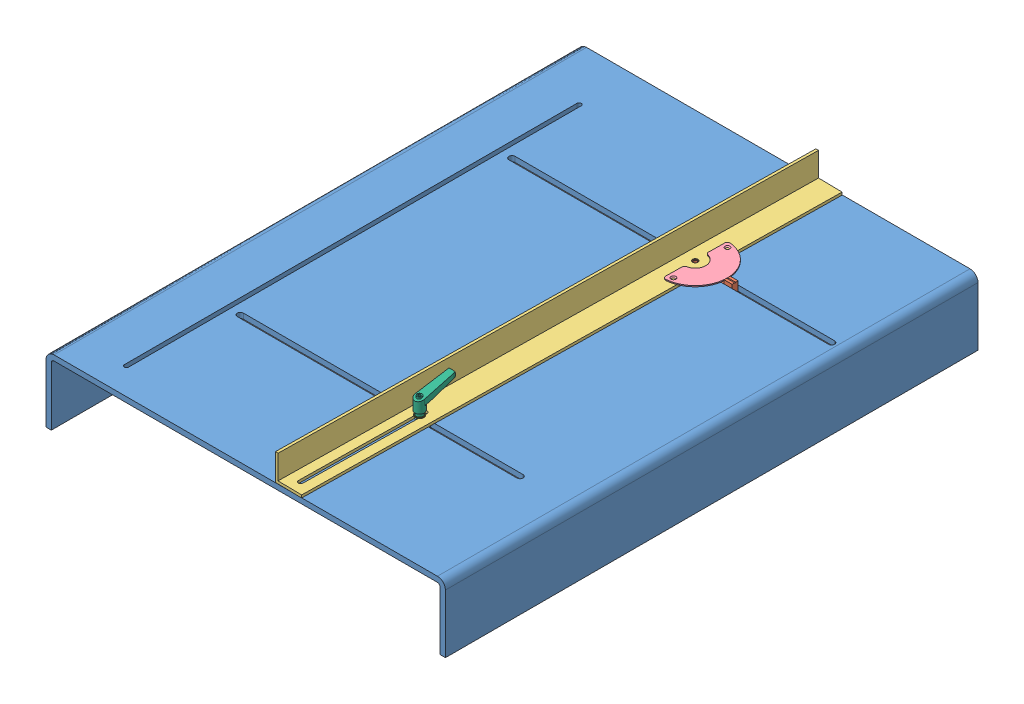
SolidWorks assembly Baugruppe1.SLDASM, configuration Standard (file format 4400). Lengths in mm.
Overall size (750 184.61 1000.64).
7 component instances, 7 part files, 16 mates.
Components (placement in the parent):
- Tischplatte-1: Tischplatte.SLDPRT [Standard] at (-425.3848 -43.7019 0) size (750 125 1000)
- Nutenstein lang-1: Nutenstein lang.SLDPRT [Standard] at (23.6145 64.2981 259) x (0 0 -1) z (1 0 0) size (18 24 95)
- Anschlag 2-1: Anschlag 2.SLDPRT [Standard] at (4.9049 81.2981 999.505) x (0.999888 0 0.01495) z (-0.01495 0 0.999888) size (50 50 1000)
- Skala-1: Skala.SLDPRT [Standard] at (43.6145 86.2981 250) x (0.01495 0 -0.999888) z (0 1 0) size (119.54 60 2)
- Nutenstein kurz-1: Nutenstein kurz.SLDPRT [Standard] at (20.9891 65.2981 769) x (0 0 -1) z (1 0 0) size (18 14 30)
- Klemmhebel-1: Klemmhebel.SLDPRT [Standard] at (35.9891 87.8981 760) x (0.998301 0 0.058264) z (-0.058264 0 0.998301) size (37.75 78.01 70.8)
- Plain Washer Grade A_DIN-1: Plain Washer Grade A_DIN.sldprt [Washer DIN 125 - A 8.4] at (35.9891 87.8981 760) x (0 1 0) z (0 0 1) size (1.6 16 16)
Mates (geometry in assembly coordinates):
- Deckungsgleich2: coincident anti-aligned: plane of Tischplatte-1 through (-415.3848 71.2981 1000) normal (0 -1 0); plane of Nutenstein lang-1 through (118.6145 71.2981 241) normal (0 1 0)
- Deckungsgleich33: coincident anti-aligned: plane of Anschlag 2-1 through (24.8546 86.2981 -0.3084) normal (0 1 0); plane of Skala-1 through (48.9802 86.2981 225.5826) normal (0 -1 0)
- Konzentrisch12: concentric anti-aligned: cylinder of Anschlag 2-1 through (43.6145 86.2981 250) axis (0 1 0) radius 5; cylinder of Skala-1 through (43.6145 88.2981 250) axis (0 -1 0) radius 20
- Parallel1: parallel anti-aligned: plane of Anschlag 2-1 through (24.8546 131.2981 -0.3084) normal (0.999888 0 0.01495); plane of Skala-1 through (43.9807 88.2981 225.5078) normal (-0.999888 0 -0.01495)
- Deckungsgleich35: coincident anti-aligned: plane of Tischplatte-1 through (-300.3848 -540.31 244.25) normal (0 0 1); plane of Nutenstein lang-1 through (118.6145 71.2981 244.25) normal (0 0 -1)
- Deckungsgleich36: coincident anti-aligned: plane of Tischplatte-1 through (-425.3848 81.2981 1000) normal (0 1 0); plane of Anschlag 2-1 through (69.8496 81.2981 0.3643) normal (0 -1 0)
- Konzentrisch13: concentric aligned: cylinder of Nutenstein lang-1 through (43.6145 80.2981 250) axis (0 1 0) radius 5; cylinder of Anschlag 2-1 through (43.6145 86.2981 250) axis (0 1 0) radius 5
- Deckungsgleich43: coincident anti-aligned: plane of Tischplatte-1 through (-415.3848 71.2981 1000) normal (0 -1 0); plane of Nutenstein kurz-1 through (50.9891 71.2981 751) normal (0 1 0)
- Deckungsgleich44: coincident anti-aligned: plane of Tischplatte-1 through (-300.3848 -43.7029 754.25) normal (0 0 1); plane of Nutenstein kurz-1 through (50.9891 71.2981 754.25) normal (0 0 -1)
- Konzentrisch14: concentric aligned: cylinder of Nutenstein kurz-1 through (35.9891 79.2981 760) axis (0 1 0) radius 3.4; cylinder of Klemmhebel-1 through (35.9891 62.8981 760) axis (0 1 0) radius 4
- Konzentrisch15: concentric anti-aligned: cylinder of Klemmhebel-1 through (35.9891 62.8981 760) axis (0 1 0) radius 4; cylinder of Plain Washer Grade A_DIN-1 through (35.9891 52.9731 760) axis (0 -1 0) radius 4.2
- Deckungsgleich47: coincident anti-aligned: plane of Klemmhebel-1 through (35.9891 87.8981 760) normal (0 -1 0); plane of Plain Washer Grade A_DIN-1 through (31.7891 87.8981 760) normal (0 1 0)
- Deckungsgleich48: coincident anti-aligned: plane of Anschlag 2-1 through (24.8546 86.2981 -0.3084) normal (0 1 0); plane of Plain Washer Grade A_DIN-1 through (27.9891 86.2981 760) normal (0 -1 0)
- Abstand6: distance = 0.25 mm anti-aligned: plane of Anschlag 2-1 through (28.4513 81.2971 979.8549) normal (0.999888 0 0.01495); cylinder of Klemmhebel-1 through (35.9891 62.8981 760) axis (0 1 0) radius 4
- LimitAbstand4: limit distance = 71.4993 mm: line of Nutenstein lang-1 through (43.6145 65.1481 250) axis (0 1 0); line of assembly
- LimitAbstand5: limit distance = 73.8738 mm: line of Nutenstein kurz-1 through (35.9891 66.1481 760) axis (0 1 0)
